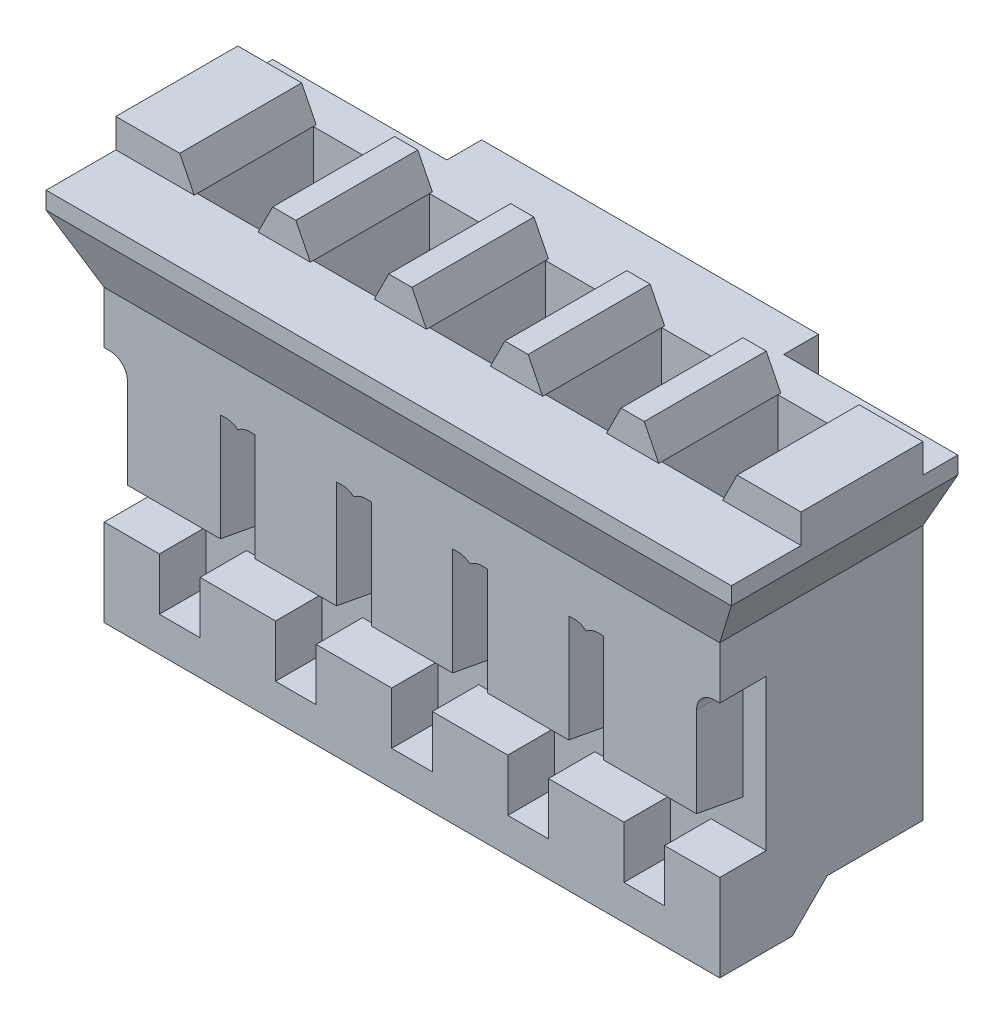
from build123d import *

# Parameters (mm, degrees)
EXTRUDE_1_DEPTH          = 9.9
EXTRUDE_1_DEPTH_BACK     = 1.9
SKETCH_6_W               = 5.8
SKETCH_6_H               = 0.6
EXTRUDE_2_DEPTH          = 5.75
CUT_EXTRUDE_2_DEPTH      = 13.482888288
CUT_EXTRUDE_5_DEPTH      = 13.717802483
CUT_EXTRUDE_5_DEPTH_BACK = 13.717802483
CUT_EXTRUDE_1_DEPTH      = 0.8
SKETCH_4_W               = 0.6
SKETCH_4_H               = 0.6
CUT_EXTRUDE_3_DEPTH      = 3.8
SKETCH_5_W               = 1.1
SKETCH_5_H               = 2
CUT_EXTRUDE_4_DEPTH      = 1.8
PATTERN_LINEAR_1_COUNT   = 5
PATTERN_LINEAR_1_PITCH   = 2


with BuildPart() as part:
    # Sketch 1 → Extrude 1 (new, two sides: drawn at the far end of the back side and taken through both)
    with BuildSketch(Plane(origin=(0, 0, 0), x_dir=(0, 0, -1), z_dir=(1, 0, 0)).offset(-EXTRUDE_1_DEPTH_BACK)):
        Polygon((0, 0.6), (1.65, 0.6), (1.65, 6.35), (1.05, 6.35), (1.05, 6.85), (-1.05, 6.85), (-1.05, 6.35), (-2.25, 6.35), (-2.25, 6.05), (-1.85, 5), (-1.85, 2.25), (-1.05, 2.1), (-1.05, 1.5), (-1.85, 1.5), (-1.85, 0), (-0.6, 0), align=None)
    extrude(amount=EXTRUDE_1_DEPTH + EXTRUDE_1_DEPTH_BACK)

    # Sketch 6 → Extrude 2 (add)
    with BuildSketch(Plane(origin=(0, 6.35, 0), x_dir=(-1, 0, 0), z_dir=(0, 1, 0))):
        with Locations((-4, -1.95)):
            Rectangle(SKETCH_6_W, SKETCH_6_H)
    extrude(amount=-EXTRUDE_2_DEPTH)

    # Sketch 3 → Cut-Extrude 2 (cut, through all)
    with BuildSketch(Plane.XY.offset(1.05)):
        Polygon((-0.8, 6.85), (-0.55, 6.35), (0.55, 6.35), (0.8, 6.85), align=None)
    cut_extrude_2 = extrude(amount=-CUT_EXTRUDE_2_DEPTH, mode=Mode.SUBTRACT)

    # Sketch 7 → Cut-Extrude 5 (cut, two sides: drawn at the far end of the back side and taken through both)
    with BuildSketch(Plane.XY.offset(1.85).offset(-CUT_EXTRUDE_5_DEPTH_BACK)):
        Polygon((-1.9, 6.05), (-1.9, 0), (-1.3, 0), (-1.3, 5), align=None)
        Polygon((9.3, 5), (9.9, 6.05), (9.9, 0), (9.3, 0), align=None)
    extrude(amount=CUT_EXTRUDE_5_DEPTH + CUT_EXTRUDE_5_DEPTH_BACK, mode=Mode.SUBTRACT)

    # Sketch 2 → Cut-Extrude 1 (cut)
    with BuildSketch(Plane.XY.offset(1.85)):
        with BuildLine():
            Line((-1.3, 4.1), (-1.2, 4.1))
            ThreePointArc((-1.2, 4.1), (-0.987867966, 4.012132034), (-0.9, 3.8))
            Line((-0.9, 3.8), (-0.9, 2.1))
            Line((-0.9, 2.1), (0.9, 2.1))
            Line((0.9, 2.1), (0.9, 3.8))
            ThreePointArc((0.9, 3.8), (0.987867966, 4.012132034), (1.2, 4.1))
            Line((1.2, 4.1), (1.3, 4.1))
            Line((1.3, 4.1), (1.3, 1.5))
            Line((1.3, 1.5), (0.35, 1.5))
            Line((0.35, 1.5), (0.35, 0.6))
            Line((0.35, 0.6), (-0.35, 0.6))
            Line((-0.35, 0.6), (-0.35, 1.5))
            Line((-0.35, 1.5), (-1.3, 1.5))
            Line((-1.3, 1.5), (-1.3, 4.1))
        make_face()
    cut_extrude_1 = extrude(amount=-CUT_EXTRUDE_1_DEPTH, mode=Mode.SUBTRACT)

    # Sketch 4 → Cut-Extrude 3 (cut)
    with BuildSketch(Plane.XZ.offset(-0.6)):
        with Locations((0, -0.3)):
            Rectangle(SKETCH_4_W, SKETCH_4_H)
    cut_extrude_3 = extrude(amount=-CUT_EXTRUDE_3_DEPTH, mode=Mode.SUBTRACT)

    # Sketch 5 → Cut-Extrude 4 (cut)
    with BuildSketch(Plane(origin=(0, 6.35, 0), x_dir=(-1, 0, 0), z_dir=(0, 1, 0))):
        Rectangle(SKETCH_5_W, SKETCH_5_H)
    cut_extrude_4 = extrude(amount=-CUT_EXTRUDE_4_DEPTH, mode=Mode.SUBTRACT)

    # Pattern Linear 1: Cut-Extrude 2, Cut-Extrude 1, Cut-Extrude 3, Cut-Extrude 4 ×5
    with Locations(*[(i * PATTERN_LINEAR_1_PITCH, 0, 0) for i in range(1, PATTERN_LINEAR_1_COUNT)]):
        add(cut_extrude_2, mode=Mode.SUBTRACT)
        add(cut_extrude_1, mode=Mode.SUBTRACT)
        add(cut_extrude_3, mode=Mode.SUBTRACT)
        add(cut_extrude_4, mode=Mode.SUBTRACT)


solid = part.part
